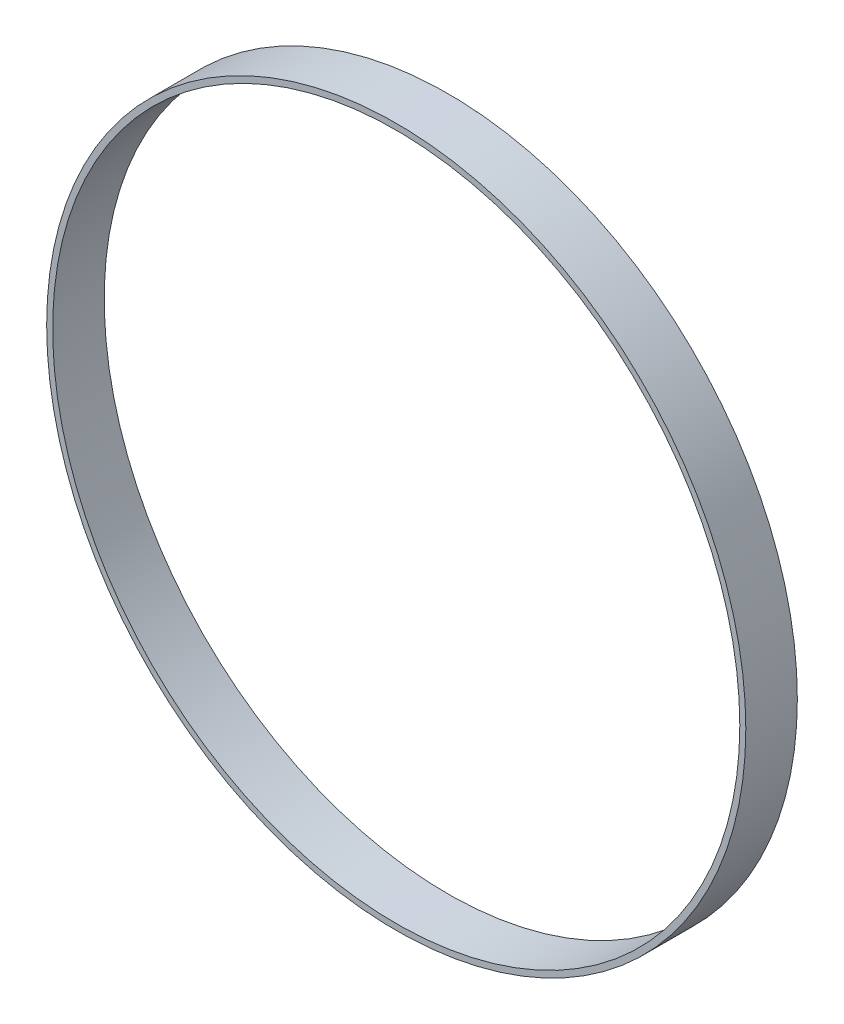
ISO-10303-21;
HEADER;
FILE_DESCRIPTION(('STEP AP214'),'2;1');
FILE_NAME('part.step','',(''),(''),'','','');
FILE_SCHEMA(('AUTOMOTIVE_DESIGN { 1 0 10303 214 1 1 1 1 }'));
ENDSEC;
DATA;
#1=APPLICATION_CONTEXT('core data for automotive mechanical design processes');
#2=APPLICATION_PROTOCOL_DEFINITION('international standard','automotive_design',2000,#1);
#3=PRODUCT_CONTEXT('',#1,'mechanical');
#4=PRODUCT('Part','Part','',(#3));
#5=PRODUCT_RELATED_PRODUCT_CATEGORY('part','',(#4));
#6=PRODUCT_DEFINITION_FORMATION('','',#4);
#7=PRODUCT_DEFINITION_CONTEXT('part definition',#1,'design');
#8=PRODUCT_DEFINITION('design','',#6,#7);
#9=PRODUCT_DEFINITION_SHAPE('','',#8);
#10=(LENGTH_UNIT() NAMED_UNIT(*) SI_UNIT(.MILLI.,.METRE.));
#11=(NAMED_UNIT(*) PLANE_ANGLE_UNIT() SI_UNIT($,.RADIAN.));
#12=(NAMED_UNIT(*) SI_UNIT($,.STERADIAN.) SOLID_ANGLE_UNIT());
#13=UNCERTAINTY_MEASURE_WITH_UNIT(LENGTH_MEASURE(1.E-05),#10,'distance_accuracy_value','');
#14=(GEOMETRIC_REPRESENTATION_CONTEXT(3) GLOBAL_UNCERTAINTY_ASSIGNED_CONTEXT((#13)) GLOBAL_UNIT_ASSIGNED_CONTEXT((#10,
#11,#12)) REPRESENTATION_CONTEXT('',''));
#15=CARTESIAN_POINT('',(0.,0.,0.));
#16=DIRECTION('',(0.,0.,1.));
#17=DIRECTION('',(1.,0.,0.));
#18=AXIS2_PLACEMENT_3D('',#15,#16,#17);
#19=CARTESIAN_POINT('',(0.,0.,6.));
#20=DIRECTION('',(0.,0.,1.));
#21=DIRECTION('',(1.,0.,0.));
#22=AXIS2_PLACEMENT_3D('',#19,#20,#21);
#23=PLANE('',#22);
#24=CARTESIAN_POINT('',(0.,0.,6.));
#25=DIRECTION('',(0.,0.,1.));
#26=DIRECTION('',(1.,0.,0.));
#27=AXIS2_PLACEMENT_3D('',#24,#25,#26);
#28=CIRCLE('',#27,40.7);
#29=CARTESIAN_POINT('',(40.7,0.,6.));
#30=VERTEX_POINT('',#29);
#31=EDGE_CURVE('E10',#30,#30,#28,.T.);
#32=ORIENTED_EDGE('',*,*,#31,.T.);
#33=EDGE_LOOP('',(#32));
#34=FACE_BOUND('',#33,.T.);
#35=CARTESIAN_POINT('',(0.,0.,6.));
#36=DIRECTION('',(0.,0.,1.));
#37=DIRECTION('',(1.,0.,0.));
#38=AXIS2_PLACEMENT_3D('',#35,#36,#37);
#39=CIRCLE('',#38,40.);
#40=CARTESIAN_POINT('',(40.,0.,6.));
#41=VERTEX_POINT('',#40);
#42=EDGE_CURVE('E40',#41,#41,#39,.T.);
#43=ORIENTED_EDGE('',*,*,#42,.F.);
#44=EDGE_LOOP('',(#43));
#45=FACE_BOUND('',#44,.T.);
#46=ADVANCED_FACE('F29',(#34,#45),#23,.T.);
#47=CARTESIAN_POINT('',(0.,0.,0.));
#48=DIRECTION('',(0.,0.,1.));
#49=DIRECTION('',(1.,0.,0.));
#50=AXIS2_PLACEMENT_3D('',#47,#48,#49);
#51=PLANE('',#50);
#52=CARTESIAN_POINT('',(0.,0.,0.));
#53=DIRECTION('',(0.,0.,1.));
#54=DIRECTION('',(1.,0.,0.));
#55=AXIS2_PLACEMENT_3D('',#52,#53,#54);
#56=CIRCLE('',#55,40.7);
#57=CARTESIAN_POINT('',(40.7,0.,0.));
#58=VERTEX_POINT('',#57);
#59=EDGE_CURVE('E36',#58,#58,#56,.T.);
#60=ORIENTED_EDGE('',*,*,#59,.F.);
#61=EDGE_LOOP('',(#60));
#62=FACE_BOUND('',#61,.T.);
#63=CARTESIAN_POINT('',(0.,0.,0.));
#64=DIRECTION('',(0.,0.,1.));
#65=DIRECTION('',(1.,0.,0.));
#66=AXIS2_PLACEMENT_3D('',#63,#64,#65);
#67=CIRCLE('',#66,40.);
#68=CARTESIAN_POINT('',(40.,0.,0.));
#69=VERTEX_POINT('',#68);
#70=EDGE_CURVE('E44',#69,#69,#67,.T.);
#71=ORIENTED_EDGE('',*,*,#70,.T.);
#72=EDGE_LOOP('',(#71));
#73=FACE_BOUND('',#72,.T.);
#74=ADVANCED_FACE('F50',(#62,#73),#51,.F.);
#75=CARTESIAN_POINT('',(0.,0.,6.));
#76=DIRECTION('',(0.,0.,-1.));
#77=DIRECTION('',(-1.,0.,0.));
#78=AXIS2_PLACEMENT_3D('',#75,#76,#77);
#79=CYLINDRICAL_SURFACE('',#78,40.7);
#80=ORIENTED_EDGE('',*,*,#31,.F.);
#81=EDGE_LOOP('',(#80));
#82=FACE_BOUND('',#81,.T.);
#83=ORIENTED_EDGE('',*,*,#59,.T.);
#84=EDGE_LOOP('',(#83));
#85=FACE_BOUND('',#84,.T.);
#86=ADVANCED_FACE('F31',(#82,#85),#79,.T.);
#87=CARTESIAN_POINT('',(0.,0.,6.));
#88=DIRECTION('',(0.,0.,-1.));
#89=DIRECTION('',(-1.,0.,0.));
#90=AXIS2_PLACEMENT_3D('',#87,#88,#89);
#91=CYLINDRICAL_SURFACE('',#90,40.);
#92=ORIENTED_EDGE('',*,*,#42,.T.);
#93=EDGE_LOOP('',(#92));
#94=FACE_BOUND('',#93,.T.);
#95=ORIENTED_EDGE('',*,*,#70,.F.);
#96=EDGE_LOOP('',(#95));
#97=FACE_BOUND('',#96,.T.);
#98=ADVANCED_FACE('F52',(#94,#97),#91,.F.);
#99=CLOSED_SHELL('',(#46,#74,#86,#98));
#100=MANIFOLD_SOLID_BREP('B2',#99);
#101=ADVANCED_BREP_SHAPE_REPRESENTATION('',(#18,#100),#14);
#102=SHAPE_DEFINITION_REPRESENTATION(#9,#101);
ENDSEC;
END-ISO-10303-21;
